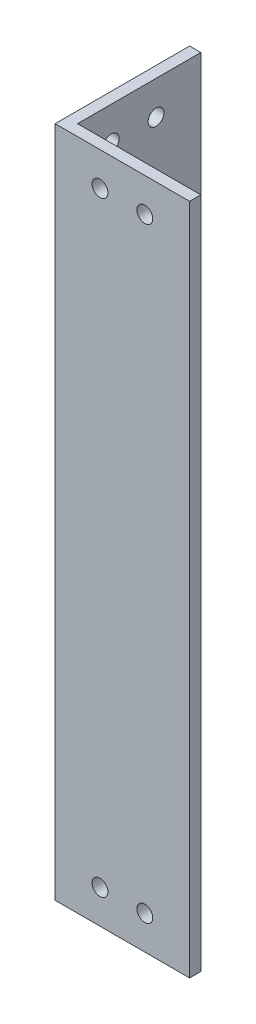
from build123d import *

# Parameters (mm, degrees)
BOSS_EXTRUDE1_DEPTH   = 190.5
F_8_CLEARANCE_HOLE1_D = 4.4958
MIRROR3_COPY_1_D      = 4.4958


with BuildPart() as part:
    # Sketch1 → Boss-Extrude1 (new body)
    with BuildSketch(Plane(origin=(0, 0, 0), x_dir=(1, 0, 0), z_dir=(0, 1, 0))):
        Polygon((0, 0), (0, 38.1), (3.175, 38.1), (3.175, 3.175), (38.1, 3.175), (38.1, 0), align=None)
    extrude(amount=BOSS_EXTRUDE1_DEPTH)

    # 8 Clearance Hole1 (through all)
    with Locations(Plane.XY):
        with Locations((12.7, 9.525), (25.4, 9.525)):
            f_8_clearance_hole1 = Hole(F_8_CLEARANCE_HOLE1_D / 2)

    # Mirror1: 8 Clearance Hole1 across plane
    add(f_8_clearance_hole1.mirror(Plane(origin=(0, 0, 0), x_dir=(-0.7071067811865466, 0, 0.7071067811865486), z_dir=(-0.7071067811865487, 0, -0.7071067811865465))), mode=Mode.SUBTRACT)

    # Mirror3: 8 Clearance Hole1 across plane
    add(f_8_clearance_hole1.mirror(Plane(origin=(0, 95.25, 0), x_dir=(0, 0, 1), z_dir=(0, -1, 0))), mode=Mode.SUBTRACT)

    # Mirror3 copy 1 (through all)
    with Locations(Plane(origin=(0, 190.5, 0), x_dir=(0, 0, -1), z_dir=(-1, 0, 0))):
        with Locations((12.7, 9.525), (25.4, 9.525)):
            Hole(MIRROR3_COPY_1_D / 2)


solid = part.part
